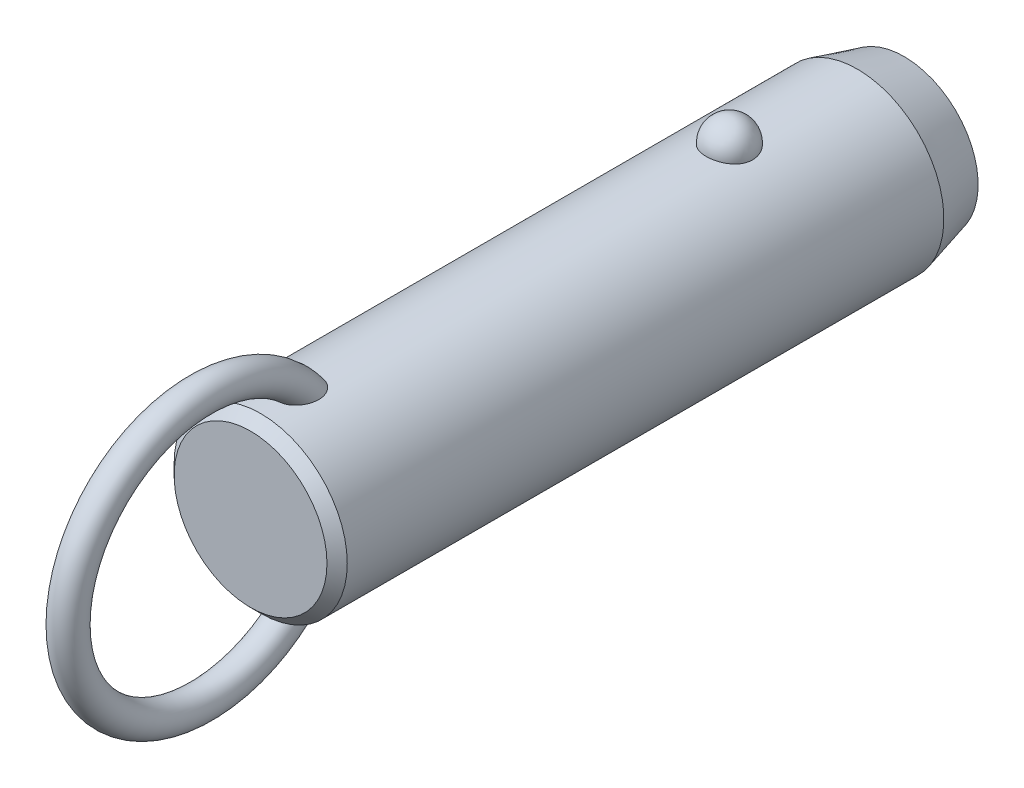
ISO-10303-21;
HEADER;
FILE_DESCRIPTION(('STEP AP214'),'2;1');
FILE_NAME('part.step','',(''),(''),'','','');
FILE_SCHEMA(('AUTOMOTIVE_DESIGN { 1 0 10303 214 1 1 1 1 }'));
ENDSEC;
DATA;
#1=APPLICATION_CONTEXT('core data for automotive mechanical design processes');
#2=APPLICATION_PROTOCOL_DEFINITION('international standard','automotive_design',2000,#1);
#3=PRODUCT_CONTEXT('',#1,'mechanical');
#4=PRODUCT('Part','Part','',(#3));
#5=PRODUCT_RELATED_PRODUCT_CATEGORY('part','',(#4));
#6=PRODUCT_DEFINITION_FORMATION('','',#4);
#7=PRODUCT_DEFINITION_CONTEXT('part definition',#1,'design');
#8=PRODUCT_DEFINITION('design','',#6,#7);
#9=PRODUCT_DEFINITION_SHAPE('','',#8);
#10=(LENGTH_UNIT() NAMED_UNIT(*) SI_UNIT(.MILLI.,.METRE.));
#11=(NAMED_UNIT(*) PLANE_ANGLE_UNIT() SI_UNIT($,.RADIAN.));
#12=(NAMED_UNIT(*) SI_UNIT($,.STERADIAN.) SOLID_ANGLE_UNIT());
#13=UNCERTAINTY_MEASURE_WITH_UNIT(LENGTH_MEASURE(1.E-05),#10,'distance_accuracy_value','');
#14=(GEOMETRIC_REPRESENTATION_CONTEXT(3) GLOBAL_UNCERTAINTY_ASSIGNED_CONTEXT((#13)) GLOBAL_UNIT_ASSIGNED_CONTEXT((#10,
#11,#12)) REPRESENTATION_CONTEXT('',''));
#15=CARTESIAN_POINT('',(0.,0.,0.));
#16=DIRECTION('',(0.,0.,1.));
#17=DIRECTION('',(1.,0.,0.));
#18=AXIS2_PLACEMENT_3D('',#15,#16,#17);
#19=CARTESIAN_POINT('',(0.,0.,45.7));
#20=DIRECTION('',(0.,0.,-1.));
#21=DIRECTION('',(-1.,0.,0.));
#22=AXIS2_PLACEMENT_3D('',#19,#20,#21);
#23=CYLINDRICAL_SURFACE('',#22,11.1);
#24=CARTESIAN_POINT('',(2.9724815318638,10.6945945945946,-3.));
#25=CARTESIAN_POINT('',(2.97247830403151,10.6945972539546,-2.83225059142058));
#26=CARTESIAN_POINT('',(2.95876598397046,10.6984356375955,-2.6644597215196));
#27=CARTESIAN_POINT('',(2.90424529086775,10.7133624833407,-2.33362381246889));
#28=CARTESIAN_POINT('',(2.8634252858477,10.7244540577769,-2.1705808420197));
#29=CARTESIAN_POINT('',(2.75573657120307,10.7526272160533,-1.85396767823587));
#30=CARTESIAN_POINT('',(2.68887937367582,10.7697061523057,-1.70039333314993));
#31=CARTESIAN_POINT('',(2.53079696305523,10.8079438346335,-1.40691598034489));
#32=CARTESIAN_POINT('',(2.43957264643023,10.8291024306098,-1.2670124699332));
#33=CARTESIAN_POINT('',(2.23458150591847,10.8732541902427,-1.00409565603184));
#34=CARTESIAN_POINT('',(2.12071295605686,10.8962553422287,-0.881162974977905));
#35=CARTESIAN_POINT('',(1.87365402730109,10.9414421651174,-0.656352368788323));
#36=CARTESIAN_POINT('',(1.74046358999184,10.9636278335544,-0.554474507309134));
#37=CARTESIAN_POINT('',(1.45872188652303,11.0046495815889,-0.374872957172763));
#38=CARTESIAN_POINT('',(1.31021276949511,11.0234944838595,-0.297085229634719));
#39=CARTESIAN_POINT('',(1.00170030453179,11.0557957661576,-0.16752977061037));
#40=CARTESIAN_POINT('',(0.841698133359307,11.0692526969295,-0.115759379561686));
#41=CARTESIAN_POINT('',(0.517607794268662,11.0890932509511,-0.040392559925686));
#42=CARTESIAN_POINT('',(0.353633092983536,11.0955916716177,-0.0163383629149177));
#43=CARTESIAN_POINT('',(0.0238420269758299,11.1011989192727,0.00445177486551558));
#44=CARTESIAN_POINT('',(-0.141974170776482,11.1003084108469,0.00119017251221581));
#45=CARTESIAN_POINT('',(-0.468405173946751,11.0912990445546,-0.0323233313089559));
#46=CARTESIAN_POINT('',(-0.629059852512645,11.0832767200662,-0.0622147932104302));
#47=CARTESIAN_POINT('',(-0.942937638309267,11.0609962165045,-0.147645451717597));
#48=CARTESIAN_POINT('',(-1.09616062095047,11.0467379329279,-0.203185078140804));
#49=CARTESIAN_POINT('',(-1.39181061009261,11.0134071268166,-0.3387529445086));
#50=CARTESIAN_POINT('',(-1.53417383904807,10.9943086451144,-0.418913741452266));
#51=CARTESIAN_POINT('',(-1.80342160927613,10.9533667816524,-0.601448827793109));
#52=CARTESIAN_POINT('',(-1.9303046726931,10.9315231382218,-0.703825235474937));
#53=CARTESIAN_POINT('',(-2.16747598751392,10.887005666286,-0.930091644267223));
#54=CARTESIAN_POINT('',(-2.27742774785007,10.8643239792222,-1.05433291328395));
#55=CARTESIAN_POINT('',(-2.47517316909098,10.8209886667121,-1.31966633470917));
#56=CARTESIAN_POINT('',(-2.56296538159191,10.8003351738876,-1.46075958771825));
#57=CARTESIAN_POINT('',(-2.71500300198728,10.7631304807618,-1.75753646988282));
#58=CARTESIAN_POINT('',(-2.77898901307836,10.7466250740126,-1.9133588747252));
#59=CARTESIAN_POINT('',(-2.88046189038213,10.7198747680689,-2.2339152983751));
#60=CARTESIAN_POINT('',(-2.91794947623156,10.709629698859,-2.39864907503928));
#61=CARTESIAN_POINT('',(-2.96537819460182,10.6965949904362,-2.73165170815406));
#62=CARTESIAN_POINT('',(-2.97542891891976,10.693775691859,-2.89990378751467));
#63=CARTESIAN_POINT('',(-2.96804271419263,10.6958279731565,-3.235752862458));
#64=CARTESIAN_POINT('',(-2.95060646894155,10.7006993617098,-3.40334987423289));
#65=CARTESIAN_POINT('',(-2.88883358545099,10.71753912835,-3.73233906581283));
#66=CARTESIAN_POINT('',(-2.84462026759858,10.7294749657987,-3.89375610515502));
#67=CARTESIAN_POINT('',(-2.73050447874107,10.7590797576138,-4.20667949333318));
#68=CARTESIAN_POINT('',(-2.66060103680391,10.7767489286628,-4.35818546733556));
#69=CARTESIAN_POINT('',(-2.49642559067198,10.8159599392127,-4.6478542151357));
#70=CARTESIAN_POINT('',(-2.40203047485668,10.8375211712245,-4.78594458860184));
#71=CARTESIAN_POINT('',(-2.19143488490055,10.8820570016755,-5.0441038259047));
#72=CARTESIAN_POINT('',(-2.07523364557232,10.9050316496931,-5.16417205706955));
#73=CARTESIAN_POINT('',(-1.82361254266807,10.9499219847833,-5.38334833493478));
#74=CARTESIAN_POINT('',(-1.68812945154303,10.9718338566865,-5.48238464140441));
#75=CARTESIAN_POINT('',(-1.40191298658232,11.0120611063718,-5.65618873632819));
#76=CARTESIAN_POINT('',(-1.25118062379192,11.0303767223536,-5.73095813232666));
#77=CARTESIAN_POINT('',(-0.940570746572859,11.0611653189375,-5.85334725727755));
#78=CARTESIAN_POINT('',(-0.780821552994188,11.0737044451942,-5.90127578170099));
#79=CARTESIAN_POINT('',(-0.455204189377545,11.0918598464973,-5.96992976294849));
#80=CARTESIAN_POINT('',(-0.289336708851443,11.0974768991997,-5.99065827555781));
#81=CARTESIAN_POINT('',(0.0406846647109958,11.1011307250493,-6.00418773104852));
#82=CARTESIAN_POINT('',(0.204817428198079,11.099299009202,-5.99747318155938));
#83=CARTESIAN_POINT('',(0.529553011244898,11.088551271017,-5.9574031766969));
#84=CARTESIAN_POINT('',(0.690155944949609,11.0796354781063,-5.92404858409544));
#85=CARTESIAN_POINT('',(1.0027760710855,11.0557204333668,-5.83180084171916));
#86=CARTESIAN_POINT('',(1.15482001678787,11.0407414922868,-5.77299291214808));
#87=CARTESIAN_POINT('',(1.44678373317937,11.0062913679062,-5.63147366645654));
#88=CARTESIAN_POINT('',(1.58670279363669,10.9868199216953,-5.54876095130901));
#89=CARTESIAN_POINT('',(1.8527023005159,10.9451315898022,-5.36027644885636));
#90=CARTESIAN_POINT('',(1.97855158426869,10.9228788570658,-5.25418644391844));
#91=CARTESIAN_POINT('',(2.21080872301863,10.8782509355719,-5.02251354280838));
#92=CARTESIAN_POINT('',(2.31721312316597,10.8558757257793,-4.89692718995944));
#93=CARTESIAN_POINT('',(2.5094551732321,10.8130715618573,-4.62745408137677));
#94=CARTESIAN_POINT('',(2.59493284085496,10.7926798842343,-4.48330448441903));
#95=CARTESIAN_POINT('',(2.740862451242,10.7565495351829,-4.18236358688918));
#96=CARTESIAN_POINT('',(2.80132490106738,10.7408089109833,-4.02557762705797));
#97=CARTESIAN_POINT('',(2.88959070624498,10.7173718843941,-3.72475308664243));
#98=CARTESIAN_POINT('',(2.92062102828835,10.7088950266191,-3.58171216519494));
#99=CARTESIAN_POINT('',(2.96206765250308,10.6975052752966,-3.29245795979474));
#100=CARTESIAN_POINT('',(2.97248434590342,10.6945922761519,-3.14624473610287));
#101=CARTESIAN_POINT('',(2.9724815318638,10.6945945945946,-3.));
#102=B_SPLINE_CURVE_WITH_KNOTS('',3,(#24,#25,#26,#27,#28,#29,#30,#31,#32,#33,#34,#35,#36,#37,
#38,#39,#40,#41,#42,#43,#44,#45,#46,#47,#48,#49,#50,#51,#52,#53,#54,#55,#56,#57,#58,#59,#60,#61,
#62,#63,#64,#65,#66,#67,#68,#69,#70,#71,#72,#73,#74,#75,#76,#77,#78,#79,#80,#81,#82,#83,#84,#85,
#86,#87,#88,#89,#90,#91,#92,#93,#94,#95,#96,#97,#98,#99,#100,#101),.UNSPECIFIED.,.T.,.F.,(4,2,2,
2,2,2,2,2,2,2,2,2,2,2,2,2,2,2,2,2,2,2,2,2,2,2,2,2,2,2,2,2,2,2,2,2,2,2,4),(0.,0.502722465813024,
1.00566079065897,1.5083769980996,2.01107471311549,2.51608392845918,3.02109467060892,
3.52475118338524,4.02835620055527,4.523518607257,5.0186364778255,5.50715297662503,
5.9956776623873,6.48688002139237,6.97812923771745,7.47814366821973,7.9781907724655,
8.48353712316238,8.9888697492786,9.49218093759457,9.99547960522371,10.4964777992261,
10.997494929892,11.5010810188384,12.0046847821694,12.5099796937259,13.0152411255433,
13.5145635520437,14.0138298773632,14.5043200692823,14.9947943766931,15.4836390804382,
15.9725123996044,16.4685040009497,16.9645836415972,17.4686765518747,17.972557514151,
18.410841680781,18.849117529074),.UNSPECIFIED.);
#103=CARTESIAN_POINT('',(2.9724815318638,10.6945945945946,-3.));
#104=VERTEX_POINT('',#103);
#105=EDGE_CURVE('E41',#104,#104,#102,.T.);
#106=ORIENTED_EDGE('',*,*,#105,.T.);
#107=EDGE_LOOP('',(#106));
#108=FACE_BOUND('',#107,.T.);
#109=CARTESIAN_POINT('',(0.,0.,57.1));
#110=DIRECTION('',(0.,0.,1.));
#111=DIRECTION('',(1.,0.,0.));
#112=AXIS2_PLACEMENT_3D('',#109,#110,#111);
#113=CIRCLE('',#112,11.1);
#114=CARTESIAN_POINT('',(11.1,0.,57.1));
#115=VERTEX_POINT('',#114);
#116=EDGE_CURVE('E10',#115,#115,#113,.F.);
#117=ORIENTED_EDGE('',*,*,#116,.T.);
#118=EDGE_LOOP('',(#117));
#119=FACE_BOUND('',#118,.T.);
#120=CARTESIAN_POINT('',(-0.56452033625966,-11.0856356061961,49.3578154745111));
#121=CARTESIAN_POINT('',(-0.66720283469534,-11.0804062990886,49.3912839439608));
#122=CARTESIAN_POINT('',(-0.766875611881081,-11.0738877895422,49.4338357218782));
#123=CARTESIAN_POINT('',(-0.957284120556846,-11.0590576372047,49.5354190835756));
#124=CARTESIAN_POINT('',(-1.04801616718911,-11.0507452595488,49.5944574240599));
#125=CARTESIAN_POINT('',(-1.21800952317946,-11.0333016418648,49.7265293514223));
#126=CARTESIAN_POINT('',(-1.29730805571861,-11.0241732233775,49.7995156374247));
#127=CARTESIAN_POINT('',(-1.44337665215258,-11.0060026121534,49.9570374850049));
#128=CARTESIAN_POINT('',(-1.51014622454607,-10.9969604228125,50.0415734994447));
#129=CARTESIAN_POINT('',(-1.63454620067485,-10.9791841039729,50.2255213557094));
#130=CARTESIAN_POINT('',(-1.69127003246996,-10.9705107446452,50.3255493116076));
#131=CARTESIAN_POINT('',(-1.78980785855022,-10.9548648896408,50.5327902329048));
#132=CARTESIAN_POINT('',(-1.83161214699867,-10.9478935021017,50.6400078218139));
#133=CARTESIAN_POINT('',(-1.91557028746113,-10.9335803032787,50.9054080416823));
#134=CARTESIAN_POINT('',(-1.95040620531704,-10.9273269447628,51.0659806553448));
#135=CARTESIAN_POINT('',(-1.99388326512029,-10.9194709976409,51.3906977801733));
#136=CARTESIAN_POINT('',(-2.00248051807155,-10.9178762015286,51.5548478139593));
#137=CARTESIAN_POINT('',(-1.99551615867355,-10.9191578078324,51.9246504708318));
#138=CARTESIAN_POINT('',(-1.9732206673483,-10.9232807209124,52.1301911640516));
#139=CARTESIAN_POINT('',(-1.9152976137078,-10.9335244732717,52.433595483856));
#140=CARTESIAN_POINT('',(-1.89184575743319,-10.9376266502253,52.5340883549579));
#141=CARTESIAN_POINT('',(-1.83700674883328,-10.9469720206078,52.732855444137));
#142=CARTESIAN_POINT('',(-1.80562070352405,-10.9522150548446,52.8311299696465));
#143=CARTESIAN_POINT('',(-1.73463055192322,-10.9636837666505,53.0259148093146));
#144=CARTESIAN_POINT('',(-1.69493416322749,-10.9699202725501,53.1223907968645));
#145=CARTESIAN_POINT('',(-1.60745141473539,-10.9830806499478,53.3116262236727));
#146=CARTESIAN_POINT('',(-1.55966150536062,-10.9900048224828,53.4043840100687));
#147=CARTESIAN_POINT('',(-1.45591812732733,-11.0042280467,53.5846907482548));
#148=CARTESIAN_POINT('',(-1.40000013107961,-11.0115253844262,53.6722601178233));
#149=CARTESIAN_POINT('',(-1.2793747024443,-11.0261911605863,53.841029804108));
#150=CARTESIAN_POINT('',(-1.21467835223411,-11.0335594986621,53.9222379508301));
#151=CARTESIAN_POINT('',(-1.08218150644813,-11.0473027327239,54.0690010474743));
#152=CARTESIAN_POINT('',(-1.0152263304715,-11.0537063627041,54.1353092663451));
#153=CARTESIAN_POINT('',(-0.872952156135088,-11.065850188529,54.258378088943));
#154=CARTESIAN_POINT('',(-0.797642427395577,-11.0715911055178,54.3151491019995));
#155=CARTESIAN_POINT('',(-0.651396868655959,-11.081071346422,54.4075155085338));
#156=CARTESIAN_POINT('',(-0.581712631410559,-11.0849841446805,54.4450491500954));
#157=CARTESIAN_POINT('',(-0.437066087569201,-11.0916271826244,54.5082594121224));
#158=CARTESIAN_POINT('',(-0.362109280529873,-11.0943586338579,54.5339481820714));
#159=CARTESIAN_POINT('',(-0.207828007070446,-11.0983242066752,54.571117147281));
#160=CARTESIAN_POINT('',(-0.128467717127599,-11.0995432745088,54.5824545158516));
#161=CARTESIAN_POINT('',(0.0309101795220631,-11.1002423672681,54.5889658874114));
#162=CARTESIAN_POINT('',(0.110927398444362,-11.0997233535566,54.5841488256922));
#163=CARTESIAN_POINT('',(0.256406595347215,-11.097240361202,54.5609599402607));
#164=CARTESIAN_POINT('',(0.322235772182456,-11.0955074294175,54.5447543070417));
#165=CARTESIAN_POINT('',(0.450635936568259,-11.0910350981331,54.5026008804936));
#166=CARTESIAN_POINT('',(0.513205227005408,-11.0882951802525,54.4766480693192));
#167=CARTESIAN_POINT('',(0.662626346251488,-11.0805620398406,54.4026073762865));
#168=CARTESIAN_POINT('',(0.747127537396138,-11.0751144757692,54.3498452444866));
#169=CARTESIAN_POINT('',(0.906756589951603,-11.0631932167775,54.2317206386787));
#170=CARTESIAN_POINT('',(0.981859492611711,-11.0567168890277,54.1663257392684));
#171=CARTESIAN_POINT('',(1.1071220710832,-11.0447856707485,54.0422633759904));
#172=CARTESIAN_POINT('',(1.15909566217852,-11.0394280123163,53.9853831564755));
#173=CARTESIAN_POINT('',(1.25791923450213,-11.0286040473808,53.8673271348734));
#174=CARTESIAN_POINT('',(1.30476642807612,-11.0231376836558,53.8061490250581));
#175=CARTESIAN_POINT('',(1.43818612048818,-11.0068027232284,53.617305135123));
#176=CARTESIAN_POINT('',(1.51751767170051,-10.9960104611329,53.4844531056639));
#177=CARTESIAN_POINT('',(1.63597546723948,-10.9788847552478,53.2531371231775));
#178=CARTESIAN_POINT('',(1.67988876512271,-10.9722190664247,53.1570530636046));
#179=CARTESIAN_POINT('',(1.75953241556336,-10.9597298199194,52.9614311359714));
#180=CARTESIAN_POINT('',(1.79525967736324,-10.9539065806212,52.8618919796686));
#181=CARTESIAN_POINT('',(1.85844731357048,-10.9433632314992,52.6602111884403));
#182=CARTESIAN_POINT('',(1.88591073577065,-10.9386427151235,52.5580705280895));
#183=CARTESIAN_POINT('',(1.93234324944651,-10.9305350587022,52.351819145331));
#184=CARTESIAN_POINT('',(1.95131065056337,-10.9271481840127,52.2477080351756));
#185=CARTESIAN_POINT('',(1.99040203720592,-10.9201183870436,51.9654588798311));
#186=CARTESIAN_POINT('',(2.00221217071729,-10.9179256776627,51.7860370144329));
#187=CARTESIAN_POINT('',(1.99711676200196,-10.9188636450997,51.4277133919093));
#188=CARTESIAN_POINT('',(1.98026150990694,-10.9219849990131,51.248811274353));
#189=CARTESIAN_POINT('',(1.92151657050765,-10.9324473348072,50.9364514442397));
#190=CARTESIAN_POINT('',(1.88605081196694,-10.9386915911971,50.8017594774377));
#191=CARTESIAN_POINT('',(1.79393020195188,-10.9541780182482,50.5399669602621));
#192=CARTESIAN_POINT('',(1.73729868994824,-10.9634168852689,50.4128582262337));
#193=CARTESIAN_POINT('',(1.61237037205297,-10.9824218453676,50.1894184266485));
#194=CARTESIAN_POINT('',(1.54715374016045,-10.9918945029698,50.0913455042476));
#195=CARTESIAN_POINT('',(1.40127026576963,-11.0114415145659,49.9074341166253));
#196=CARTESIAN_POINT('',(1.3206074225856,-11.0215157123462,49.8215924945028));
#197=CARTESIAN_POINT('',(1.1447478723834,-11.041168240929,49.6651630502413));
#198=CARTESIAN_POINT('',(1.0494780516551,-11.0507437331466,49.5946565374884));
#199=CARTESIAN_POINT('',(0.847278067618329,-11.0680789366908,49.472640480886));
#200=CARTESIAN_POINT('',(0.740351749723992,-11.0758392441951,49.4211246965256));
#201=CARTESIAN_POINT('',(0.52928931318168,-11.0878275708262,49.3434852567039));
#202=CARTESIAN_POINT('',(0.425895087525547,-11.0923259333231,49.315377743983));
#203=CARTESIAN_POINT('',(0.215723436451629,-11.0984001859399,49.2777038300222));
#204=CARTESIAN_POINT('',(0.108947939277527,-11.0999777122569,49.2681270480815));
#205=CARTESIAN_POINT('',(-0.0938962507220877,-11.1000196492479,49.2678773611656));
#206=CARTESIAN_POINT('',(-0.189967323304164,-11.0987797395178,49.2754089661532));
#207=CARTESIAN_POINT('',(-0.3796579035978,-11.0939111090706,49.3055079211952));
#208=CARTESIAN_POINT('',(-0.473277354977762,-11.0902823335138,49.3280756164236));
#209=CARTESIAN_POINT('',(-0.56452033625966,-11.0856356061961,49.3578154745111));
#210=B_SPLINE_CURVE_WITH_KNOTS('',3,(#120,#121,#122,#123,#124,#125,#126,#127,#128,#129,#130,
#131,#132,#133,#134,#135,#136,#137,#138,#139,#140,#141,#142,#143,#144,#145,#146,#147,#148,#149,
#150,#151,#152,#153,#154,#155,#156,#157,#158,#159,#160,#161,#162,#163,#164,#165,#166,#167,#168,
#169,#170,#171,#172,#173,#174,#175,#176,#177,#178,#179,#180,#181,#182,#183,#184,#185,#186,#187,
#188,#189,#190,#191,#192,#193,#194,#195,#196,#197,#198,#199,#200,#201,#202,#203,#204,#205,#206,
#207,#208,#209),.UNSPECIFIED.,.T.,.F.,(4,2,2,2,2,2,2,2,2,2,2,2,2,2,2,2,2,2,2,2,2,2,2,2,2,2,2,2,
2,2,2,2,2,2,2,2,2,2,2,2,2,2,2,2,4),(0.,0.323999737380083,0.648132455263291,0.971184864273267,
1.29424994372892,1.63886237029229,1.98369857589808,2.4742605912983,2.96564271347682,
3.58257396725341,3.89215258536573,4.20168803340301,4.51486273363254,4.82817514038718,
5.14015911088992,5.45175282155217,5.734428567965,6.01679375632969,6.25364580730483,
6.49025437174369,6.72919963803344,6.9680127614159,7.17061258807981,7.37331685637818,
7.67094989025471,7.96935728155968,8.20075067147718,8.4322692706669,8.8958162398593,
9.21306533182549,9.53043400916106,9.84768549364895,10.1650000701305,10.70229304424,
11.2386443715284,11.6553390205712,12.0715755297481,12.4245637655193,12.7774607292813,
13.1321855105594,13.4867936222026,13.8068771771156,14.1267813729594,14.4146787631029,
14.7025827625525),.UNSPECIFIED.);
#211=CARTESIAN_POINT('',(-0.56452033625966,-11.0856356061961,49.3578154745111));
#212=VERTEX_POINT('',#211);
#213=EDGE_CURVE('E60',#212,#212,#210,.T.);
#214=ORIENTED_EDGE('',*,*,#213,.T.);
#215=EDGE_LOOP('',(#214));
#216=FACE_BOUND('',#215,.T.);
#217=CARTESIAN_POINT('',(-0.56452033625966,11.0856356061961,49.3578154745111));
#218=CARTESIAN_POINT('',(-0.468542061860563,11.0905203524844,49.3265456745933));
#219=CARTESIAN_POINT('',(-0.369793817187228,11.0942886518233,49.3031576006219));
#220=CARTESIAN_POINT('',(-0.16955579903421,11.0991586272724,49.2730858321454));
#221=CARTESIAN_POINT('',(-0.0680604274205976,11.1002543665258,49.2664393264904));
#222=CARTESIAN_POINT('',(0.134549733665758,11.099646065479,49.2701579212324));
#223=CARTESIAN_POINT('',(0.235664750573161,11.0979441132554,49.2805103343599));
#224=CARTESIAN_POINT('',(0.434632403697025,11.0919342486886,49.3178318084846));
#225=CARTESIAN_POINT('',(0.532486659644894,11.0876276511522,49.3447924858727));
#226=CARTESIAN_POINT('',(0.722445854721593,11.0768742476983,49.4144096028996));
#227=CARTESIAN_POINT('',(0.814543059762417,11.0704246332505,49.4570866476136));
#228=CARTESIAN_POINT('',(0.990565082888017,11.0560659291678,49.5566487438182));
#229=CARTESIAN_POINT('',(1.07448844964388,11.048156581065,49.6135363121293));
#230=CARTESIAN_POINT('',(1.23562672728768,11.0313221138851,49.7422106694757));
#231=CARTESIAN_POINT('',(1.31242684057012,11.0223686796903,49.8145117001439));
#232=CARTESIAN_POINT('',(1.45398030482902,11.0045918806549,49.9700425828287));
#233=CARTESIAN_POINT('',(1.51873073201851,10.9957685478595,50.0532750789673));
#234=CARTESIAN_POINT('',(1.64107232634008,10.9782087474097,50.2363842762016));
#235=CARTESIAN_POINT('',(1.6974317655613,10.9695572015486,50.3370893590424));
#236=CARTESIAN_POINT('',(1.79515063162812,10.9539887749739,50.5456264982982));
#237=CARTESIAN_POINT('',(1.83649966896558,10.9470730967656,50.6534634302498));
#238=CARTESIAN_POINT('',(1.91931148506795,10.9329211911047,50.9203995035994));
#239=CARTESIAN_POINT('',(1.95340104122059,10.9267904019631,51.0818612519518));
#240=CARTESIAN_POINT('',(1.99526195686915,10.9192174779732,51.4082163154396));
#241=CARTESIAN_POINT('',(2.00298989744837,10.9177830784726,51.5731148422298));
#242=CARTESIAN_POINT('',(1.99396251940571,10.9194420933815,51.9441006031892));
#243=CARTESIAN_POINT('',(1.97050829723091,10.923774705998,52.1500387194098));
#244=CARTESIAN_POINT('',(1.91079643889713,10.9343131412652,52.4539019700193));
#245=CARTESIAN_POINT('',(1.8867370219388,10.9385106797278,52.5545296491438));
#246=CARTESIAN_POINT('',(1.83065508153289,10.9480376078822,52.7535107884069));
#247=CARTESIAN_POINT('',(1.79863369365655,10.9533668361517,52.851864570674));
#248=CARTESIAN_POINT('',(1.72633365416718,10.9649954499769,53.0467203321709));
#249=CARTESIAN_POINT('',(1.68596409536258,10.9713053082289,53.1431879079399));
#250=CARTESIAN_POINT('',(1.59707998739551,10.9845964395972,53.3323233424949));
#251=CARTESIAN_POINT('',(1.54856169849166,10.9915780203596,53.4249894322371));
#252=CARTESIAN_POINT('',(1.4433016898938,11.0058935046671,53.6049752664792));
#253=CARTESIAN_POINT('',(1.38659749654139,11.0132257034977,53.692316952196));
#254=CARTESIAN_POINT('',(1.26431158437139,11.0279330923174,53.8604563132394));
#255=CARTESIAN_POINT('',(1.198741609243,11.0353082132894,53.9412624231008));
#256=CARTESIAN_POINT('',(1.06542088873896,11.048931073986,54.0859856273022));
#257=CARTESIAN_POINT('',(0.998640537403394,11.0552153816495,54.150784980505));
#258=CARTESIAN_POINT('',(0.856896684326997,11.0671032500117,54.2708462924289));
#259=CARTESIAN_POINT('',(0.781942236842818,11.0727075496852,54.3261186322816));
#260=CARTESIAN_POINT('',(0.636276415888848,11.081949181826,54.4159721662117));
#261=CARTESIAN_POINT('',(0.566755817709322,11.0857572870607,54.4524410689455));
#262=CARTESIAN_POINT('',(0.422602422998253,11.0921860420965,54.5135333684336));
#263=CARTESIAN_POINT('',(0.347974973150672,11.0948079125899,54.5381689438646));
#264=CARTESIAN_POINT('',(0.194593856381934,11.0985608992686,54.5733233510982));
#265=CARTESIAN_POINT('',(0.11580793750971,11.0996777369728,54.5837069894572));
#266=CARTESIAN_POINT('',(-0.042249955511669,11.1002003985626,54.5885747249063));
#267=CARTESIAN_POINT('',(-0.121521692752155,11.09960699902,54.583066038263));
#268=CARTESIAN_POINT('',(-0.266046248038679,11.0970123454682,54.5588271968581));
#269=CARTESIAN_POINT('',(-0.331661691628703,11.0952283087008,54.5421356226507));
#270=CARTESIAN_POINT('',(-0.459588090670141,11.0906663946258,54.4991117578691));
#271=CARTESIAN_POINT('',(-0.521897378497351,11.0878880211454,54.472774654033));
#272=CARTESIAN_POINT('',(-0.67144642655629,11.0800342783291,54.3975130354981));
#273=CARTESIAN_POINT('',(-0.756250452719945,11.0744969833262,54.343818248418));
#274=CARTESIAN_POINT('',(-0.916349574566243,11.0624045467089,54.2238029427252));
#275=CARTESIAN_POINT('',(-0.991618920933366,11.0558467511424,54.1574493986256));
#276=CARTESIAN_POINT('',(-1.11713140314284,11.0437783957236,54.0316335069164));
#277=CARTESIAN_POINT('',(-1.16920539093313,11.0383619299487,53.9739524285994));
#278=CARTESIAN_POINT('',(-1.26817476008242,11.02743010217,53.8542809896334));
#279=CARTESIAN_POINT('',(-1.315067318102,11.0219146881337,53.7922883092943));
#280=CARTESIAN_POINT('',(-1.40399813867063,11.0109399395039,53.6647843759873));
#281=CARTESIAN_POINT('',(-1.4460286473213,11.0054807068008,53.5992677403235));
#282=CARTESIAN_POINT('',(-1.52538779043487,10.9947621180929,53.4654223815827));
#283=CARTESIAN_POINT('',(-1.56271516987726,10.9895028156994,53.3970929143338));
#284=CARTESIAN_POINT('',(-1.64537943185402,10.9774790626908,53.2332101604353));
#285=CARTESIAN_POINT('',(-1.68879497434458,10.9708503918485,53.1366735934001));
#286=CARTESIAN_POINT('',(-1.76740738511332,10.9584602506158,52.9402369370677));
#287=CARTESIAN_POINT('',(-1.80260120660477,10.95269910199,52.8403356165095));
#288=CARTESIAN_POINT('',(-1.86468657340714,10.9423003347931,52.6379663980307));
#289=CARTESIAN_POINT('',(-1.8915816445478,10.9376622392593,52.5354996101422));
#290=CARTESIAN_POINT('',(-1.93682458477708,10.9297405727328,52.3286429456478));
#291=CARTESIAN_POINT('',(-1.95517082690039,10.9264572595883,52.2242527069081));
#292=CARTESIAN_POINT('',(-1.99232562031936,10.9197647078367,51.9426287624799));
#293=CARTESIAN_POINT('',(-2.00294603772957,10.9177914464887,51.7641857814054));
#294=CARTESIAN_POINT('',(-1.99566675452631,10.9191290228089,51.4079962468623));
#295=CARTESIAN_POINT('',(-1.97781651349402,10.9224306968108,51.2302490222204));
#296=CARTESIAN_POINT('',(-1.91747214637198,10.9331592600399,50.9197921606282));
#297=CARTESIAN_POINT('',(-1.88131022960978,10.9395108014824,50.785825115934));
#298=CARTESIAN_POINT('',(-1.78790380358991,10.9551659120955,50.5255975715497));
#299=CARTESIAN_POINT('',(-1.73068309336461,10.9644661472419,50.3993285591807));
#300=CARTESIAN_POINT('',(-1.60475573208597,10.9835398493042,50.1774156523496));
#301=CARTESIAN_POINT('',(-1.53908879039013,10.9930297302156,50.0800265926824));
#302=CARTESIAN_POINT('',(-1.39238608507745,11.0125708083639,49.8975250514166));
#303=CARTESIAN_POINT('',(-1.31135150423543,11.0226219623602,49.8124116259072));
#304=CARTESIAN_POINT('',(-1.14382035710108,11.0411991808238,49.6652994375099));
#305=CARTESIAN_POINT('',(-1.05858500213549,11.0497792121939,49.6018693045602));
#306=CARTESIAN_POINT('',(-0.878723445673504,11.0655285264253,49.4902505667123));
#307=CARTESIAN_POINT('',(-0.784123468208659,11.0727015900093,49.4420208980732));
#308=CARTESIAN_POINT('',(-0.646163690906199,11.0812501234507,49.386023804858));
#309=CARTESIAN_POINT('',(-0.605595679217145,11.0835451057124,49.3711978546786));
#310=CARTESIAN_POINT('',(-0.56452033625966,11.0856356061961,49.3578154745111));
#311=B_SPLINE_CURVE_WITH_KNOTS('',3,(#217,#218,#219,#220,#221,#222,#223,#224,#225,#226,#227,
#228,#229,#230,#231,#232,#233,#234,#235,#236,#237,#238,#239,#240,#241,#242,#243,#244,#245,#246,
#247,#248,#249,#250,#251,#252,#253,#254,#255,#256,#257,#258,#259,#260,#261,#262,#263,#264,#265,
#266,#267,#268,#269,#270,#271,#272,#273,#274,#275,#276,#277,#278,#279,#280,#281,#282,#283,#284,
#285,#286,#287,#288,#289,#290,#291,#292,#293,#294,#295,#296,#297,#298,#299,#300,#301,#302,#303,
#304,#305,#306,#307,#308,#309,#310),.UNSPECIFIED.,.T.,.F.,(4,2,2,2,2,2,2,2,2,2,2,2,2,2,2,2,2,2,
2,2,2,2,2,2,2,2,2,2,2,2,2,2,2,2,2,2,2,2,2,2,2,2,2,2,2,2,4),(0.,0.303061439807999,
0.606795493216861,0.910302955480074,1.21365733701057,1.51741085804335,1.82121821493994,
2.13745205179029,2.45376252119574,2.799586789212,3.14564996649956,3.63832391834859,
4.13180893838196,4.75031912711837,5.0607192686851,5.37107516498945,5.68500772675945,
5.99908475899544,6.3117651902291,6.62403542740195,6.90315673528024,7.18197194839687,
7.41687778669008,7.6515413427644,7.8884158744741,8.12518286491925,8.32752842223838,
8.52997509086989,8.82986421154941,9.13054668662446,9.36393502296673,9.59744991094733,
9.83133221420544,10.0652767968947,10.383032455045,10.7009056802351,11.0186436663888,
11.3364420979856,11.8705925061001,12.4038159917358,12.8189662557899,13.2336487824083,
13.5857049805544,13.9377340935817,14.2561354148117,14.5736690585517,14.7033687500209),.UNSPECIFIED.);
#312=CARTESIAN_POINT('',(-0.56452033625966,11.0856356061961,49.3578154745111));
#313=VERTEX_POINT('',#312);
#314=EDGE_CURVE('E68',#313,#313,#311,.T.);
#315=ORIENTED_EDGE('',*,*,#314,.T.);
#316=EDGE_LOOP('',(#315));
#317=FACE_BOUND('',#316,.T.);
#318=CARTESIAN_POINT('',(0.,0.,-19.4000000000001));
#319=DIRECTION('',(0.,0.,-1.));
#320=DIRECTION('',(-1.,0.,0.));
#321=AXIS2_PLACEMENT_3D('',#318,#319,#320);
#322=CIRCLE('',#321,11.1);
#323=CARTESIAN_POINT('',(-11.1,0.,-19.4000000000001));
#324=VERTEX_POINT('',#323);
#325=EDGE_CURVE('E57',#324,#324,#322,.F.);
#326=ORIENTED_EDGE('',*,*,#325,.T.);
#327=EDGE_LOOP('',(#326));
#328=FACE_BOUND('',#327,.T.);
#329=ADVANCED_FACE('F37',(#108,#119,#216,#317,#328),#23,.T.);
#330=CARTESIAN_POINT('',(0.,0.,-25.4));
#331=DIRECTION('',(0.,0.,-1.));
#332=DIRECTION('',(-1.,0.,0.));
#333=AXIS2_PLACEMENT_3D('',#330,#331,#332);
#334=PLANE('',#333);
#335=CARTESIAN_POINT('',(0.,0.,-25.4));
#336=DIRECTION('',(0.,0.,-1.));
#337=DIRECTION('',(-1.,0.,0.));
#338=AXIS2_PLACEMENT_3D('',#335,#336,#337);
#339=CIRCLE('',#338,9.49230484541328);
#340=CARTESIAN_POINT('',(-9.49230484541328,0.,-25.4));
#341=VERTEX_POINT('',#340);
#342=EDGE_CURVE('E67',#341,#341,#339,.T.);
#343=ORIENTED_EDGE('',*,*,#342,.T.);
#344=EDGE_LOOP('',(#343));
#345=FACE_BOUND('',#344,.T.);
#346=ADVANCED_FACE('F86',(#345),#334,.T.);
#347=CARTESIAN_POINT('',(0.,0.,-25.4));
#348=DIRECTION('',(0.,0.,1.));
#349=DIRECTION('',(1.,0.,0.));
#350=AXIS2_PLACEMENT_3D('',#347,#348,#349);
#351=CONICAL_SURFACE('',#350,9.49230484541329,0.26179938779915);
#352=ORIENTED_EDGE('',*,*,#325,.F.);
#353=EDGE_LOOP('',(#352));
#354=FACE_BOUND('',#353,.T.);
#355=ORIENTED_EDGE('',*,*,#342,.F.);
#356=EDGE_LOOP('',(#355));
#357=FACE_BOUND('',#356,.T.);
#358=ADVANCED_FACE('F84',(#354,#357),#351,.T.);
#359=CARTESIAN_POINT('',(0.,0.,58.4));
#360=DIRECTION('',(0.,0.,1.));
#361=DIRECTION('',(1.,0.,0.));
#362=AXIS2_PLACEMENT_3D('',#359,#360,#361);
#363=PLANE('',#362);
#364=CARTESIAN_POINT('',(0.,0.,58.4));
#365=DIRECTION('',(0.,0.,1.));
#366=DIRECTION('',(1.,0.,0.));
#367=AXIS2_PLACEMENT_3D('',#364,#365,#366);
#368=CIRCLE('',#367,9.80000000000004);
#369=CARTESIAN_POINT('',(9.80000000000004,0.,58.4));
#370=VERTEX_POINT('',#369);
#371=EDGE_CURVE('E50',#370,#370,#368,.T.);
#372=ORIENTED_EDGE('',*,*,#371,.T.);
#373=EDGE_LOOP('',(#372));
#374=FACE_BOUND('',#373,.T.);
#375=ADVANCED_FACE('F78',(#374),#363,.T.);
#376=CARTESIAN_POINT('',(0.,0.,64.75));
#377=DIRECTION('',(1.,0.,0.));
#378=DIRECTION('',(0.,0.,-1.));
#379=AXIS2_PLACEMENT_3D('',#376,#377,#378);
#380=TOROIDAL_SURFACE('',#379,17.05,2.);
#381=ORIENTED_EDGE('',*,*,#314,.F.);
#382=EDGE_LOOP('',(#381));
#383=FACE_BOUND('',#382,.T.);
#384=ORIENTED_EDGE('',*,*,#213,.F.);
#385=EDGE_LOOP('',(#384));
#386=FACE_BOUND('',#385,.T.);
#387=ADVANCED_FACE('F74',(#383,#386),#380,.T.);
#388=CARTESIAN_POINT('',(0.,0.,58.4));
#389=DIRECTION('',(0.,0.,-1.));
#390=DIRECTION('',(-1.,0.,0.));
#391=AXIS2_PLACEMENT_3D('',#388,#389,#390);
#392=CONICAL_SURFACE('',#391,9.80000000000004,0.785398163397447);
#393=ORIENTED_EDGE('',*,*,#116,.F.);
#394=EDGE_LOOP('',(#393));
#395=FACE_BOUND('',#394,.T.);
#396=ORIENTED_EDGE('',*,*,#371,.F.);
#397=EDGE_LOOP('',(#396));
#398=FACE_BOUND('',#397,.T.);
#399=ADVANCED_FACE('F39',(#395,#398),#392,.T.);
#400=CARTESIAN_POINT('',(0.,11.1,-3.));
#401=DIRECTION('',(0.,1.,0.));
#402=DIRECTION('',(0.,0.,-1.));
#403=AXIS2_PLACEMENT_3D('',#400,#401,#402);
#404=SPHERICAL_SURFACE('',#403,3.);
#405=ORIENTED_EDGE('',*,*,#105,.F.);
#406=EDGE_LOOP('',(#405));
#407=FACE_BOUND('',#406,.T.);
#408=ADVANCED_FACE('F80',(#407),#404,.T.);
#409=CLOSED_SHELL('',(#329,#346,#358,#375,#387,#399,#408));
#410=MANIFOLD_SOLID_BREP('B2',#409);
#411=ADVANCED_BREP_SHAPE_REPRESENTATION('',(#18,#410),#14);
#412=SHAPE_DEFINITION_REPRESENTATION(#9,#411);
ENDSEC;
END-ISO-10303-21;
